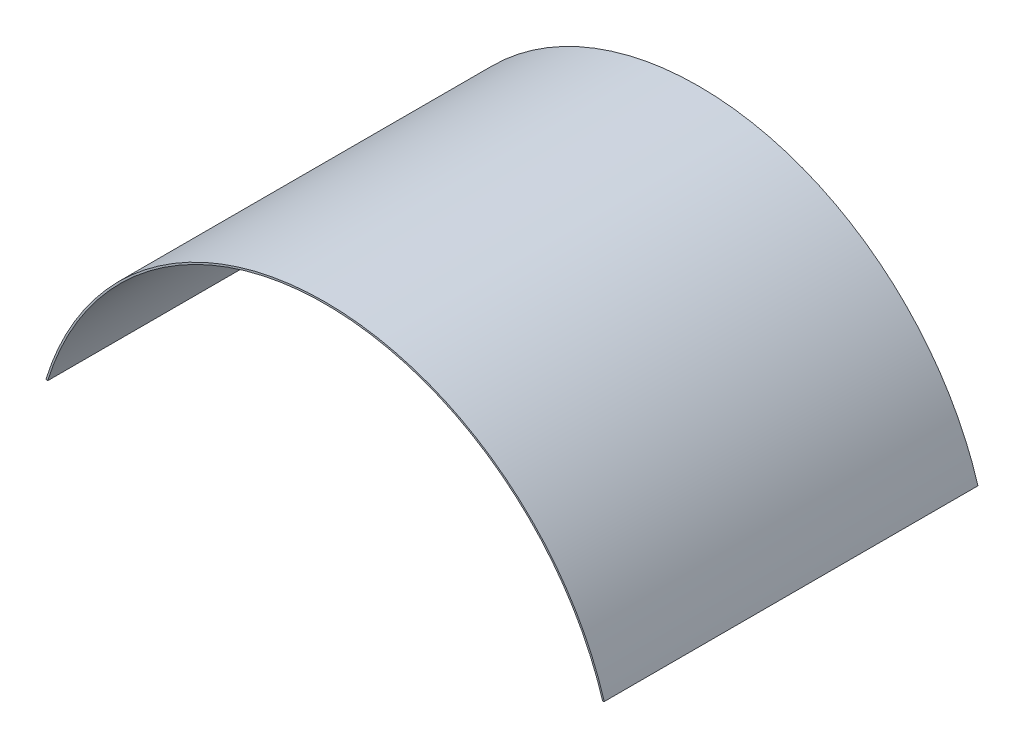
ISO-10303-21;
HEADER;
FILE_DESCRIPTION(('STEP AP214'),'2;1');
FILE_NAME('part.step','',(''),(''),'','','');
FILE_SCHEMA(('AUTOMOTIVE_DESIGN { 1 0 10303 214 1 1 1 1 }'));
ENDSEC;
DATA;
#1=APPLICATION_CONTEXT('core data for automotive mechanical design processes');
#2=APPLICATION_PROTOCOL_DEFINITION('international standard','automotive_design',2000,#1);
#3=PRODUCT_CONTEXT('',#1,'mechanical');
#4=PRODUCT('Part','Part','',(#3));
#5=PRODUCT_RELATED_PRODUCT_CATEGORY('part','',(#4));
#6=PRODUCT_DEFINITION_FORMATION('','',#4);
#7=PRODUCT_DEFINITION_CONTEXT('part definition',#1,'design');
#8=PRODUCT_DEFINITION('design','',#6,#7);
#9=PRODUCT_DEFINITION_SHAPE('','',#8);
#10=(LENGTH_UNIT() NAMED_UNIT(*) SI_UNIT(.MILLI.,.METRE.));
#11=(NAMED_UNIT(*) PLANE_ANGLE_UNIT() SI_UNIT($,.RADIAN.));
#12=(NAMED_UNIT(*) SI_UNIT($,.STERADIAN.) SOLID_ANGLE_UNIT());
#13=UNCERTAINTY_MEASURE_WITH_UNIT(LENGTH_MEASURE(1.E-05),#10,'distance_accuracy_value','');
#14=(GEOMETRIC_REPRESENTATION_CONTEXT(3) GLOBAL_UNCERTAINTY_ASSIGNED_CONTEXT((#13)) GLOBAL_UNIT_ASSIGNED_CONTEXT((#10,
#11,#12)) REPRESENTATION_CONTEXT('',''));
#15=CARTESIAN_POINT('',(0.,0.,0.));
#16=DIRECTION('',(0.,0.,1.));
#17=DIRECTION('',(1.,0.,0.));
#18=AXIS2_PLACEMENT_3D('',#15,#16,#17);
#19=CARTESIAN_POINT('',(478.102748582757,-146.348084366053,-640.));
#20=DIRECTION('',(0.,0.,1.));
#21=DIRECTION('',(1.,0.,0.));
#22=AXIS2_PLACEMENT_3D('',#19,#20,#21);
#23=CYLINDRICAL_SURFACE('',#22,497.);
#24=CARTESIAN_POINT('',(478.102748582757,-146.348084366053,0.));
#25=DIRECTION('',(0.,0.,1.));
#26=DIRECTION('',(1.,0.,0.));
#27=AXIS2_PLACEMENT_3D('',#24,#25,#26);
#28=CIRCLE('',#27,497.);
#29=CARTESIAN_POINT('',(2.86861649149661,-0.878088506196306,0.));
#30=VERTEX_POINT('',#29);
#31=CARTESIAN_POINT('',(953.336880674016,-0.878088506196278,0.));
#32=VERTEX_POINT('',#31);
#33=EDGE_CURVE('E98',#30,#32,#28,.F.);
#34=ORIENTED_EDGE('',*,*,#33,.F.);
#35=DIRECTION('',(0.,0.,1.));
#36=VECTOR('',#35,1.);
#37=CARTESIAN_POINT('',(2.86861649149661,-0.878088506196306,-640.));
#38=LINE('',#37,#36);
#39=CARTESIAN_POINT('',(2.86861649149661,-0.878088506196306,-640.));
#40=VERTEX_POINT('',#39);
#41=EDGE_CURVE('E11',#40,#30,#38,.T.);
#42=ORIENTED_EDGE('',*,*,#41,.F.);
#43=CARTESIAN_POINT('',(478.102748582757,-146.348084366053,-640.));
#44=DIRECTION('',(0.,0.,1.));
#45=DIRECTION('',(1.,0.,0.));
#46=AXIS2_PLACEMENT_3D('',#43,#44,#45);
#47=CIRCLE('',#46,497.);
#48=CARTESIAN_POINT('',(953.336880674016,-0.878088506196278,-640.));
#49=VERTEX_POINT('',#48);
#50=EDGE_CURVE('E93',#40,#49,#47,.F.);
#51=ORIENTED_EDGE('',*,*,#50,.T.);
#52=DIRECTION('',(0.,0.,1.));
#53=VECTOR('',#52,1.);
#54=CARTESIAN_POINT('',(953.336880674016,-0.878088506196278,-640.));
#55=LINE('',#54,#53);
#56=EDGE_CURVE('E36',#49,#32,#55,.T.);
#57=ORIENTED_EDGE('',*,*,#56,.T.);
#58=EDGE_LOOP('',(#34,#42,#51,#57));
#59=FACE_BOUND('',#58,.T.);
#60=ADVANCED_FACE('F33',(#59),#23,.F.);
#61=CARTESIAN_POINT('',(2.86861649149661,-0.878088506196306,-640.));
#62=DIRECTION('',(0.292696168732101,0.956205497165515,0.));
#63=DIRECTION('',(-0.956205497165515,0.292696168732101,0.));
#64=AXIS2_PLACEMENT_3D('',#61,#62,#63);
#65=PLANE('',#64);
#66=DIRECTION('',(-0.956205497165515,0.292696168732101,0.));
#67=VECTOR('',#66,1.);
#68=CARTESIAN_POINT('',(2.86861649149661,-0.878088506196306,0.));
#69=LINE('',#68,#67);
#70=CARTESIAN_POINT('',(0.,0.,0.));
#71=VERTEX_POINT('',#70);
#72=EDGE_CURVE('E66',#30,#71,#69,.T.);
#73=ORIENTED_EDGE('',*,*,#72,.T.);
#74=DIRECTION('',(0.,0.,1.));
#75=VECTOR('',#74,1.);
#76=CARTESIAN_POINT('',(0.,0.,-640.));
#77=LINE('',#76,#75);
#78=CARTESIAN_POINT('',(0.,0.,-640.));
#79=VERTEX_POINT('',#78);
#80=EDGE_CURVE('E42',#79,#71,#77,.T.);
#81=ORIENTED_EDGE('',*,*,#80,.F.);
#82=DIRECTION('',(-0.956205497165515,0.292696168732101,0.));
#83=VECTOR('',#82,1.);
#84=CARTESIAN_POINT('',(2.86861649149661,-0.878088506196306,-640.));
#85=LINE('',#84,#83);
#86=EDGE_CURVE('E81',#40,#79,#85,.T.);
#87=ORIENTED_EDGE('',*,*,#86,.F.);
#88=ORIENTED_EDGE('',*,*,#41,.T.);
#89=EDGE_LOOP('',(#73,#81,#87,#88));
#90=FACE_BOUND('',#89,.T.);
#91=ADVANCED_FACE('F108',(#90),#65,.F.);
#92=CARTESIAN_POINT('',(478.102748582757,-146.348084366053,-640.));
#93=DIRECTION('',(0.,0.,1.));
#94=DIRECTION('',(1.,0.,0.));
#95=AXIS2_PLACEMENT_3D('',#92,#93,#94);
#96=CYLINDRICAL_SURFACE('',#95,500.);
#97=CARTESIAN_POINT('',(478.102748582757,-146.348084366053,0.));
#98=DIRECTION('',(0.,0.,-1.));
#99=DIRECTION('',(-1.,0.,0.));
#100=AXIS2_PLACEMENT_3D('',#97,#98,#99);
#101=CIRCLE('',#100,500.);
#102=CARTESIAN_POINT('',(956.205497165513,0.,0.));
#103=VERTEX_POINT('',#102);
#104=EDGE_CURVE('E88',#71,#103,#101,.T.);
#105=ORIENTED_EDGE('',*,*,#104,.T.);
#106=DIRECTION('',(0.,0.,1.));
#107=VECTOR('',#106,1.);
#108=CARTESIAN_POINT('',(956.205497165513,0.,-640.));
#109=LINE('',#108,#107);
#110=CARTESIAN_POINT('',(956.205497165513,0.,-640.));
#111=VERTEX_POINT('',#110);
#112=EDGE_CURVE('E85',#111,#103,#109,.T.);
#113=ORIENTED_EDGE('',*,*,#112,.F.);
#114=CARTESIAN_POINT('',(478.102748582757,-146.348084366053,-640.));
#115=DIRECTION('',(0.,0.,-1.));
#116=DIRECTION('',(-1.,0.,0.));
#117=AXIS2_PLACEMENT_3D('',#114,#115,#116);
#118=CIRCLE('',#117,500.);
#119=EDGE_CURVE('E78',#79,#111,#118,.T.);
#120=ORIENTED_EDGE('',*,*,#119,.F.);
#121=ORIENTED_EDGE('',*,*,#80,.T.);
#122=EDGE_LOOP('',(#105,#113,#120,#121));
#123=FACE_BOUND('',#122,.T.);
#124=ADVANCED_FACE('F86',(#123),#96,.T.);
#125=CARTESIAN_POINT('',(956.205497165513,0.,-640.));
#126=DIRECTION('',(-0.292696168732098,0.956205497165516,0.));
#127=DIRECTION('',(-0.956205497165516,-0.292696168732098,0.));
#128=AXIS2_PLACEMENT_3D('',#125,#126,#127);
#129=PLANE('',#128);
#130=DIRECTION('',(-0.956205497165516,-0.292696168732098,0.));
#131=VECTOR('',#130,1.);
#132=CARTESIAN_POINT('',(956.205497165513,0.,0.));
#133=LINE('',#132,#131);
#134=EDGE_CURVE('E101',#103,#32,#133,.T.);
#135=ORIENTED_EDGE('',*,*,#134,.T.);
#136=ORIENTED_EDGE('',*,*,#56,.F.);
#137=DIRECTION('',(-0.956205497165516,-0.292696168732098,0.));
#138=VECTOR('',#137,1.);
#139=CARTESIAN_POINT('',(956.205497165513,0.,-640.));
#140=LINE('',#139,#138);
#141=EDGE_CURVE('E75',#111,#49,#140,.T.);
#142=ORIENTED_EDGE('',*,*,#141,.F.);
#143=ORIENTED_EDGE('',*,*,#112,.T.);
#144=EDGE_LOOP('',(#135,#136,#142,#143));
#145=FACE_BOUND('',#144,.T.);
#146=ADVANCED_FACE('F92',(#145),#129,.F.);
#147=CARTESIAN_POINT('',(478.102748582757,-146.348084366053,-640.));
#148=DIRECTION('',(0.,0.,1.));
#149=DIRECTION('',(1.,0.,0.));
#150=AXIS2_PLACEMENT_3D('',#147,#148,#149);
#151=PLANE('',#150);
#152=ORIENTED_EDGE('',*,*,#50,.F.);
#153=ORIENTED_EDGE('',*,*,#86,.T.);
#154=ORIENTED_EDGE('',*,*,#119,.T.);
#155=ORIENTED_EDGE('',*,*,#141,.T.);
#156=EDGE_LOOP('',(#152,#153,#154,#155));
#157=FACE_BOUND('',#156,.T.);
#158=ADVANCED_FACE('F80',(#157),#151,.F.);
#159=CARTESIAN_POINT('',(478.102748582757,-146.348084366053,0.));
#160=DIRECTION('',(0.,0.,1.));
#161=DIRECTION('',(1.,0.,0.));
#162=AXIS2_PLACEMENT_3D('',#159,#160,#161);
#163=PLANE('',#162);
#164=ORIENTED_EDGE('',*,*,#33,.T.);
#165=ORIENTED_EDGE('',*,*,#134,.F.);
#166=ORIENTED_EDGE('',*,*,#104,.F.);
#167=ORIENTED_EDGE('',*,*,#72,.F.);
#168=EDGE_LOOP('',(#164,#165,#166,#167));
#169=FACE_BOUND('',#168,.T.);
#170=ADVANCED_FACE('F106',(#169),#163,.T.);
#171=CLOSED_SHELL('',(#60,#91,#124,#146,#158,#170));
#172=MANIFOLD_SOLID_BREP('B2',#171);
#173=ADVANCED_BREP_SHAPE_REPRESENTATION('',(#18,#172),#14);
#174=SHAPE_DEFINITION_REPRESENTATION(#9,#173);
ENDSEC;
END-ISO-10303-21;
